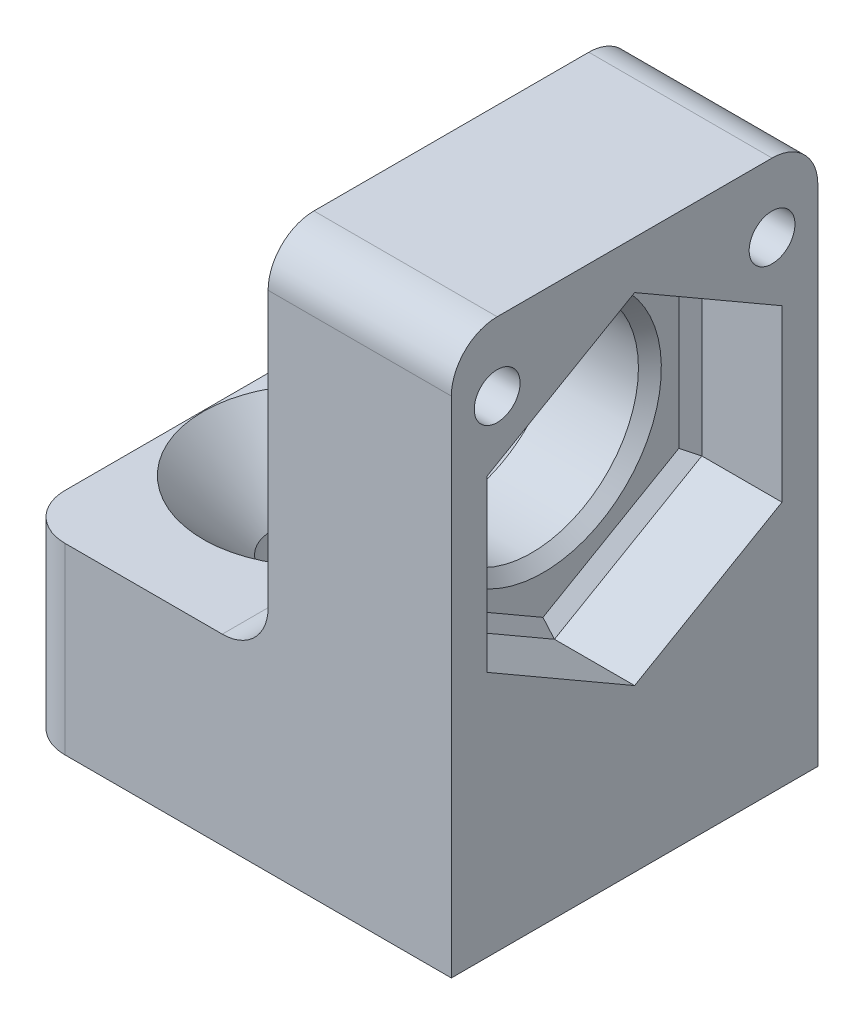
ISO-10303-21;
HEADER;
FILE_DESCRIPTION(('STEP AP214'),'2;1');
FILE_NAME('part.step','',(''),(''),'','','');
FILE_SCHEMA(('AUTOMOTIVE_DESIGN { 1 0 10303 214 1 1 1 1 }'));
ENDSEC;
DATA;
#1=APPLICATION_CONTEXT('core data for automotive mechanical design processes');
#2=APPLICATION_PROTOCOL_DEFINITION('international standard','automotive_design',2000,#1);
#3=PRODUCT_CONTEXT('',#1,'mechanical');
#4=PRODUCT('Part','Part','',(#3));
#5=PRODUCT_RELATED_PRODUCT_CATEGORY('part','',(#4));
#6=PRODUCT_DEFINITION_FORMATION('','',#4);
#7=PRODUCT_DEFINITION_CONTEXT('part definition',#1,'design');
#8=PRODUCT_DEFINITION('design','',#6,#7);
#9=PRODUCT_DEFINITION_SHAPE('','',#8);
#10=(LENGTH_UNIT() NAMED_UNIT(*) SI_UNIT(.MILLI.,.METRE.));
#11=(NAMED_UNIT(*) PLANE_ANGLE_UNIT() SI_UNIT($,.RADIAN.));
#12=(NAMED_UNIT(*) SI_UNIT($,.STERADIAN.) SOLID_ANGLE_UNIT());
#13=UNCERTAINTY_MEASURE_WITH_UNIT(LENGTH_MEASURE(1.E-05),#10,'distance_accuracy_value','');
#14=(GEOMETRIC_REPRESENTATION_CONTEXT(3) GLOBAL_UNCERTAINTY_ASSIGNED_CONTEXT((#13)) GLOBAL_UNIT_ASSIGNED_CONTEXT((#10,
#11,#12)) REPRESENTATION_CONTEXT('',''));
#15=CARTESIAN_POINT('',(0.,0.,0.));
#16=DIRECTION('',(0.,0.,1.));
#17=DIRECTION('',(1.,0.,0.));
#18=AXIS2_PLACEMENT_3D('',#15,#16,#17);
#19=CARTESIAN_POINT('',(-28.3004385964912,17.2274927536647,0.));
#20=DIRECTION('',(1.,0.,0.));
#21=DIRECTION('',(0.,1.,0.));
#22=AXIS2_PLACEMENT_3D('',#19,#20,#21);
#23=CYLINDRICAL_SURFACE('',#22,7.);
#24=CARTESIAN_POINT('',(-6.75,17.2274927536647,0.));
#25=DIRECTION('',(1.,0.,0.));
#26=DIRECTION('',(0.,0.,-1.));
#27=AXIS2_PLACEMENT_3D('',#24,#25,#26);
#28=CIRCLE('',#27,7.);
#29=CARTESIAN_POINT('',(-6.75,17.2274927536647,-7.));
#30=VERTEX_POINT('',#29);
#31=EDGE_CURVE('E784',#30,#30,#28,.T.);
#32=ORIENTED_EDGE('',*,*,#31,.T.);
#33=EDGE_LOOP('',(#32));
#34=FACE_BOUND('',#33,.T.);
#35=CARTESIAN_POINT('',(-12.,17.2274927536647,0.));
#36=DIRECTION('',(1.,0.,0.));
#37=DIRECTION('',(0.,1.,0.));
#38=AXIS2_PLACEMENT_3D('',#35,#36,#37);
#39=CIRCLE('',#38,7.);
#40=CARTESIAN_POINT('',(-12.,24.2274927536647,0.));
#41=VERTEX_POINT('',#40);
#42=EDGE_CURVE('E237',#41,#41,#39,.T.);
#43=ORIENTED_EDGE('',*,*,#42,.F.);
#44=EDGE_LOOP('',(#43));
#45=FACE_BOUND('',#44,.T.);
#46=ADVANCED_FACE('F35',(#34,#45),#23,.F.);
#47=CARTESIAN_POINT('',(-28.3004385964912,-4.5,12.));
#48=DIRECTION('',(1.,0.,0.));
#49=DIRECTION('',(0.,0.,-1.));
#50=AXIS2_PLACEMENT_3D('',#47,#48,#49);
#51=PLANE('',#50);
#52=DIRECTION('',(0.,0.,-1.));
#53=VECTOR('',#52,1.);
#54=CARTESIAN_POINT('',(-28.3004385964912,7.5,12.));
#55=LINE('',#54,#53);
#56=CARTESIAN_POINT('',(-28.3004385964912,7.5,9.));
#57=VERTEX_POINT('',#56);
#58=CARTESIAN_POINT('',(-28.3004385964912,7.5,-9.));
#59=VERTEX_POINT('',#58);
#60=EDGE_CURVE('E250',#57,#59,#55,.T.);
#61=ORIENTED_EDGE('',*,*,#60,.T.);
#62=DIRECTION('',(0.,-1.,0.));
#63=VECTOR('',#62,1.);
#64=CARTESIAN_POINT('',(-28.3004385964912,-4.5,-9.));
#65=LINE('',#64,#63);
#66=CARTESIAN_POINT('',(-28.3004385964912,-4.5,-9.));
#67=VERTEX_POINT('',#66);
#68=EDGE_CURVE('E457',#59,#67,#65,.T.);
#69=ORIENTED_EDGE('',*,*,#68,.T.);
#70=DIRECTION('',(0.,0.,-1.));
#71=VECTOR('',#70,1.);
#72=CARTESIAN_POINT('',(-28.3004385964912,-4.5,12.));
#73=LINE('',#72,#71);
#74=CARTESIAN_POINT('',(-28.3004385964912,-4.5,9.));
#75=VERTEX_POINT('',#74);
#76=EDGE_CURVE('E272',#75,#67,#73,.T.);
#77=ORIENTED_EDGE('',*,*,#76,.F.);
#78=DIRECTION('',(0.,-1.,0.));
#79=VECTOR('',#78,1.);
#80=CARTESIAN_POINT('',(-28.3004385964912,7.5,9.));
#81=LINE('',#80,#79);
#82=EDGE_CURVE('E460',#75,#57,#81,.F.);
#83=ORIENTED_EDGE('',*,*,#82,.T.);
#84=EDGE_LOOP('',(#61,#69,#77,#83));
#85=FACE_BOUND('',#84,.T.);
#86=ADVANCED_FACE('F395',(#85),#51,.F.);
#87=CARTESIAN_POINT('',(0.,-4.5,12.));
#88=DIRECTION('',(0.,1.,0.));
#89=DIRECTION('',(-1.,0.,0.));
#90=AXIS2_PLACEMENT_3D('',#87,#88,#89);
#91=PLANE('',#90);
#92=CARTESIAN_POINT('',(-21.,-4.5,0.));
#93=DIRECTION('',(0.,1.,0.));
#94=DIRECTION('',(-1.,0.,0.));
#95=AXIS2_PLACEMENT_3D('',#92,#93,#94);
#96=CIRCLE('',#95,2.75);
#97=CARTESIAN_POINT('',(-23.75,-4.5,0.));
#98=VERTEX_POINT('',#97);
#99=EDGE_CURVE('E225',#98,#98,#96,.T.);
#100=ORIENTED_EDGE('',*,*,#99,.T.);
#101=EDGE_LOOP('',(#100));
#102=FACE_BOUND('',#101,.T.);
#103=ORIENTED_EDGE('',*,*,#76,.T.);
#104=CARTESIAN_POINT('',(-25.3004385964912,-4.5,-9.));
#105=DIRECTION('',(0.,1.,0.));
#106=DIRECTION('',(-1.,0.,0.));
#107=AXIS2_PLACEMENT_3D('',#104,#105,#106);
#108=CIRCLE('',#107,3.);
#109=CARTESIAN_POINT('',(-25.3004385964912,-4.5,-12.));
#110=VERTEX_POINT('',#109);
#111=EDGE_CURVE('E450',#67,#110,#108,.F.);
#112=ORIENTED_EDGE('',*,*,#111,.T.);
#113=DIRECTION('',(1.,0.,0.));
#114=VECTOR('',#113,1.);
#115=CARTESIAN_POINT('',(0.,-4.5,-12.));
#116=LINE('',#115,#114);
#117=CARTESIAN_POINT('',(0.,-4.5,-12.));
#118=VERTEX_POINT('',#117);
#119=EDGE_CURVE('E251',#110,#118,#116,.T.);
#120=ORIENTED_EDGE('',*,*,#119,.T.);
#121=DIRECTION('',(0.,0.,-1.));
#122=VECTOR('',#121,1.);
#123=CARTESIAN_POINT('',(0.,-4.5,12.));
#124=LINE('',#123,#122);
#125=CARTESIAN_POINT('',(0.,-4.5,12.));
#126=VERTEX_POINT('',#125);
#127=EDGE_CURVE('E269',#126,#118,#124,.T.);
#128=ORIENTED_EDGE('',*,*,#127,.F.);
#129=DIRECTION('',(1.,0.,0.));
#130=VECTOR('',#129,1.);
#131=CARTESIAN_POINT('',(0.,-4.5,12.));
#132=LINE('',#131,#130);
#133=CARTESIAN_POINT('',(-25.3004385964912,-4.5,12.));
#134=VERTEX_POINT('',#133);
#135=EDGE_CURVE('E238',#134,#126,#132,.T.);
#136=ORIENTED_EDGE('',*,*,#135,.F.);
#137=CARTESIAN_POINT('',(-25.3004385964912,-4.5,9.));
#138=DIRECTION('',(0.,1.,0.));
#139=DIRECTION('',(-1.,0.,0.));
#140=AXIS2_PLACEMENT_3D('',#137,#138,#139);
#141=CIRCLE('',#140,3.);
#142=EDGE_CURVE('E453',#134,#75,#141,.F.);
#143=ORIENTED_EDGE('',*,*,#142,.T.);
#144=EDGE_LOOP('',(#103,#112,#120,#128,#136,#143));
#145=FACE_BOUND('',#144,.T.);
#146=ADVANCED_FACE('F401',(#102,#145),#91,.F.);
#147=CARTESIAN_POINT('',(0.,31.5,12.));
#148=DIRECTION('',(-1.,0.,0.));
#149=DIRECTION('',(0.,-1.,0.));
#150=AXIS2_PLACEMENT_3D('',#147,#148,#149);
#151=PLANE('',#150);
#152=DIRECTION('',(0.,-0.5,0.866025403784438));
#153=VECTOR('',#152,1.);
#154=CARTESIAN_POINT('',(0.,28.3703529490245,0.));
#155=LINE('',#154,#153);
#156=CARTESIAN_POINT('',(0.,28.3703529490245,0.));
#157=VERTEX_POINT('',#156);
#158=CARTESIAN_POINT('',(0.,22.7989228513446,9.65));
#159=VERTEX_POINT('',#158);
#160=EDGE_CURVE('E194',#157,#159,#155,.T.);
#161=ORIENTED_EDGE('',*,*,#160,.F.);
#162=DIRECTION('',(0.,0.5,0.866025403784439));
#163=VECTOR('',#162,1.);
#164=CARTESIAN_POINT('',(0.,22.7989228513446,-9.65));
#165=LINE('',#164,#163);
#166=CARTESIAN_POINT('',(0.,22.7989228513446,-9.65));
#167=VERTEX_POINT('',#166);
#168=EDGE_CURVE('E199',#167,#157,#165,.T.);
#169=ORIENTED_EDGE('',*,*,#168,.F.);
#170=DIRECTION('',(0.,1.,0.));
#171=VECTOR('',#170,1.);
#172=CARTESIAN_POINT('',(0.,11.6560626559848,-9.65));
#173=LINE('',#172,#171);
#174=CARTESIAN_POINT('',(0.,11.6560626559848,-9.65));
#175=VERTEX_POINT('',#174);
#176=EDGE_CURVE('E213',#175,#167,#173,.T.);
#177=ORIENTED_EDGE('',*,*,#176,.F.);
#178=DIRECTION('',(0.,0.5,-0.866025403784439));
#179=VECTOR('',#178,1.);
#180=CARTESIAN_POINT('',(0.,6.0846325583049,0.));
#181=LINE('',#180,#179);
#182=CARTESIAN_POINT('',(0.,6.0846325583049,0.));
#183=VERTEX_POINT('',#182);
#184=EDGE_CURVE('E207',#183,#175,#181,.T.);
#185=ORIENTED_EDGE('',*,*,#184,.F.);
#186=DIRECTION('',(0.,-0.5,-0.866025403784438));
#187=VECTOR('',#186,1.);
#188=CARTESIAN_POINT('',(0.,11.6560626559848,9.65));
#189=LINE('',#188,#187);
#190=CARTESIAN_POINT('',(0.,11.6560626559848,9.65));
#191=VERTEX_POINT('',#190);
#192=EDGE_CURVE('E205',#191,#183,#189,.T.);
#193=ORIENTED_EDGE('',*,*,#192,.F.);
#194=DIRECTION('',(0.,-1.,0.));
#195=VECTOR('',#194,1.);
#196=CARTESIAN_POINT('',(0.,22.7989228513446,9.65));
#197=LINE('',#196,#195);
#198=EDGE_CURVE('E187',#159,#191,#197,.T.);
#199=ORIENTED_EDGE('',*,*,#198,.F.);
#200=EDGE_LOOP('',(#161,#169,#177,#185,#193,#199));
#201=FACE_BOUND('',#200,.T.);
#202=CARTESIAN_POINT('',(0.,27.,9.));
#203=DIRECTION('',(-1.,0.,0.));
#204=DIRECTION('',(0.,-1.,0.));
#205=AXIS2_PLACEMENT_3D('',#202,#203,#204);
#206=CIRCLE('',#205,1.5);
#207=CARTESIAN_POINT('',(0.,25.5,9.));
#208=VERTEX_POINT('',#207);
#209=EDGE_CURVE('E234',#208,#208,#206,.T.);
#210=ORIENTED_EDGE('',*,*,#209,.T.);
#211=EDGE_LOOP('',(#210));
#212=FACE_BOUND('',#211,.T.);
#213=CARTESIAN_POINT('',(0.,27.,-9.));
#214=DIRECTION('',(-1.,0.,0.));
#215=DIRECTION('',(0.,-1.,0.));
#216=AXIS2_PLACEMENT_3D('',#213,#214,#215);
#217=CIRCLE('',#216,1.5);
#218=CARTESIAN_POINT('',(0.,25.5,-9.));
#219=VERTEX_POINT('',#218);
#220=EDGE_CURVE('E230',#219,#219,#217,.T.);
#221=ORIENTED_EDGE('',*,*,#220,.T.);
#222=EDGE_LOOP('',(#221));
#223=FACE_BOUND('',#222,.T.);
#224=DIRECTION('',(0.,1.,0.));
#225=VECTOR('',#224,1.);
#226=CARTESIAN_POINT('',(0.,31.5,-12.));
#227=LINE('',#226,#225);
#228=CARTESIAN_POINT('',(0.,28.5,-12.));
#229=VERTEX_POINT('',#228);
#230=EDGE_CURVE('E253',#118,#229,#227,.T.);
#231=ORIENTED_EDGE('',*,*,#230,.T.);
#232=CARTESIAN_POINT('',(0.,28.5,-9.));
#233=DIRECTION('',(-1.,0.,0.));
#234=DIRECTION('',(0.,-1.,0.));
#235=AXIS2_PLACEMENT_3D('',#232,#233,#234);
#236=CIRCLE('',#235,3.);
#237=CARTESIAN_POINT('',(0.,31.5,-9.));
#238=VERTEX_POINT('',#237);
#239=EDGE_CURVE('E467',#229,#238,#236,.F.);
#240=ORIENTED_EDGE('',*,*,#239,.T.);
#241=DIRECTION('',(0.,0.,-1.));
#242=VECTOR('',#241,1.);
#243=CARTESIAN_POINT('',(0.,31.5,12.));
#244=LINE('',#243,#242);
#245=CARTESIAN_POINT('',(0.,31.5,9.));
#246=VERTEX_POINT('',#245);
#247=EDGE_CURVE('E266',#246,#238,#244,.T.);
#248=ORIENTED_EDGE('',*,*,#247,.F.);
#249=CARTESIAN_POINT('',(0.,28.5,9.));
#250=DIRECTION('',(-1.,0.,0.));
#251=DIRECTION('',(0.,-1.,0.));
#252=AXIS2_PLACEMENT_3D('',#249,#250,#251);
#253=CIRCLE('',#252,3.);
#254=CARTESIAN_POINT('',(0.,28.5,12.));
#255=VERTEX_POINT('',#254);
#256=EDGE_CURVE('E469',#246,#255,#253,.F.);
#257=ORIENTED_EDGE('',*,*,#256,.T.);
#258=DIRECTION('',(0.,1.,0.));
#259=VECTOR('',#258,1.);
#260=CARTESIAN_POINT('',(0.,31.5,12.));
#261=LINE('',#260,#259);
#262=EDGE_CURVE('E240',#126,#255,#261,.T.);
#263=ORIENTED_EDGE('',*,*,#262,.F.);
#264=ORIENTED_EDGE('',*,*,#127,.T.);
#265=EDGE_LOOP('',(#231,#240,#248,#257,#263,#264));
#266=FACE_BOUND('',#265,.T.);
#267=ADVANCED_FACE('F201',(#201,#212,#223,#266),#151,.F.);
#268=CARTESIAN_POINT('',(0.,31.5,12.));
#269=DIRECTION('',(0.,-1.,0.));
#270=DIRECTION('',(0.,0.,-1.));
#271=AXIS2_PLACEMENT_3D('',#268,#269,#270);
#272=PLANE('',#271);
#273=ORIENTED_EDGE('',*,*,#247,.T.);
#274=DIRECTION('',(-1.,0.,0.));
#275=VECTOR('',#274,1.);
#276=CARTESIAN_POINT('',(0.,31.5,-9.));
#277=LINE('',#276,#275);
#278=CARTESIAN_POINT('',(-12.,31.5,-9.));
#279=VERTEX_POINT('',#278);
#280=EDGE_CURVE('E475',#238,#279,#277,.T.);
#281=ORIENTED_EDGE('',*,*,#280,.T.);
#282=DIRECTION('',(0.,0.,-1.));
#283=VECTOR('',#282,1.);
#284=CARTESIAN_POINT('',(-12.,31.5,12.));
#285=LINE('',#284,#283);
#286=CARTESIAN_POINT('',(-12.,31.5,9.));
#287=VERTEX_POINT('',#286);
#288=EDGE_CURVE('E263',#287,#279,#285,.T.);
#289=ORIENTED_EDGE('',*,*,#288,.F.);
#290=DIRECTION('',(-1.,0.,0.));
#291=VECTOR('',#290,1.);
#292=CARTESIAN_POINT('',(0.,31.5,9.));
#293=LINE('',#292,#291);
#294=EDGE_CURVE('E477',#287,#246,#293,.F.);
#295=ORIENTED_EDGE('',*,*,#294,.T.);
#296=EDGE_LOOP('',(#273,#281,#289,#295));
#297=FACE_BOUND('',#296,.T.);
#298=ADVANCED_FACE('F423',(#297),#272,.F.);
#299=CARTESIAN_POINT('',(-12.,31.5,12.));
#300=DIRECTION('',(1.,0.,0.));
#301=DIRECTION('',(0.,1.,0.));
#302=AXIS2_PLACEMENT_3D('',#299,#300,#301);
#303=PLANE('',#302);
#304=CARTESIAN_POINT('',(-12.,27.,9.));
#305=DIRECTION('',(1.,0.,0.));
#306=DIRECTION('',(0.,1.,0.));
#307=AXIS2_PLACEMENT_3D('',#304,#305,#306);
#308=CIRCLE('',#307,1.5);
#309=CARTESIAN_POINT('',(-12.,28.5,9.));
#310=VERTEX_POINT('',#309);
#311=EDGE_CURVE('E233',#310,#310,#308,.T.);
#312=ORIENTED_EDGE('',*,*,#311,.T.);
#313=EDGE_LOOP('',(#312));
#314=FACE_BOUND('',#313,.T.);
#315=CARTESIAN_POINT('',(-12.,27.,-9.));
#316=DIRECTION('',(1.,0.,0.));
#317=DIRECTION('',(0.,1.,0.));
#318=AXIS2_PLACEMENT_3D('',#315,#316,#317);
#319=CIRCLE('',#318,1.5);
#320=CARTESIAN_POINT('',(-12.,28.5,-9.));
#321=VERTEX_POINT('',#320);
#322=EDGE_CURVE('E228',#321,#321,#319,.T.);
#323=ORIENTED_EDGE('',*,*,#322,.T.);
#324=EDGE_LOOP('',(#323));
#325=FACE_BOUND('',#324,.T.);
#326=ORIENTED_EDGE('',*,*,#42,.T.);
#327=EDGE_LOOP('',(#326));
#328=FACE_BOUND('',#327,.T.);
#329=DIRECTION('',(0.,-1.,0.));
#330=VECTOR('',#329,1.);
#331=CARTESIAN_POINT('',(-12.,31.5,-12.));
#332=LINE('',#331,#330);
#333=CARTESIAN_POINT('',(-12.,28.5,-12.));
#334=VERTEX_POINT('',#333);
#335=CARTESIAN_POINT('',(-12.,10.5,-12.));
#336=VERTEX_POINT('',#335);
#337=EDGE_CURVE('E256',#334,#336,#332,.T.);
#338=ORIENTED_EDGE('',*,*,#337,.T.);
#339=DIRECTION('',(0.,0.,-1.));
#340=VECTOR('',#339,1.);
#341=CARTESIAN_POINT('',(-12.,10.5,12.));
#342=LINE('',#341,#340);
#343=CARTESIAN_POINT('',(-12.,10.5,-4.069705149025));
#344=VERTEX_POINT('',#343);
#345=EDGE_CURVE('E310',#336,#344,#342,.F.);
#346=ORIENTED_EDGE('',*,*,#345,.T.);
#347=CARTESIAN_POINT('',(-15.8318898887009,7.5,5.08459810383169));
#348=CARTESIAN_POINT('',(-12.,6.43958155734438,4.7705651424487));
#349=CARTESIAN_POINT('',(-12.,10.2637118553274,5.90304541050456));
#350=CARTESIAN_POINT('',(-15.7628445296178,7.5,5.01438811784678));
#351=CARTESIAN_POINT('',(-12.,6.54184214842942,4.77132005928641));
#352=CARTESIAN_POINT('',(-12.,10.3112369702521,5.74253702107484));
#353=CARTESIAN_POINT('',(-15.691354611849,7.5,4.93889211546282));
#354=CARTESIAN_POINT('',(-12.,6.64716684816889,4.75162963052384));
#355=CARTESIAN_POINT('',(-12.,10.3503610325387,5.57979184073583));
#356=CARTESIAN_POINT('',(-15.5449774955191,7.5,4.77673720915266));
#357=CARTESIAN_POINT('',(-12.,6.85365463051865,4.67554139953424));
#358=CARTESIAN_POINT('',(-12.,10.4138503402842,5.25179012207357));
#359=CARTESIAN_POINT('',(-15.4700982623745,7.5,4.69010367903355));
#360=CARTESIAN_POINT('',(-12.,6.95492781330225,4.62032328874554));
#361=CARTESIAN_POINT('',(-12.,10.4382484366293,5.08654002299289));
#362=CARTESIAN_POINT('',(-15.3190394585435,7.5,4.5059046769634));
#363=CARTESIAN_POINT('',(-12.,7.14688773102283,4.47969398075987));
#364=CARTESIAN_POINT('',(-12.,10.4743018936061,4.75677950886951));
#365=CARTESIAN_POINT('',(-15.2428868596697,7.5,4.4084853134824));
#366=CARTESIAN_POINT('',(-12.,7.23795378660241,4.39550800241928));
#367=CARTESIAN_POINT('',(-12.,10.486108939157,4.59228462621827));
#368=CARTESIAN_POINT('',(-15.0898673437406,7.5,4.20112417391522));
#369=CARTESIAN_POINT('',(-12.,7.40829240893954,4.20229243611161));
#370=CARTESIAN_POINT('',(-12.,10.4996224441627,4.26287413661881));
#371=CARTESIAN_POINT('',(-15.0130002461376,7.5,4.09117914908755));
#372=CARTESIAN_POINT('',(-12.,7.48794412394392,4.09382842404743));
#373=CARTESIAN_POINT('',(-12.,10.5013262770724,4.09795843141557));
#374=CARTESIAN_POINT('',(-14.8525102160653,7.5,3.84634955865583));
#375=CARTESIAN_POINT('',(-12.,7.64154425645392,3.84504143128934));
#376=CARTESIAN_POINT('',(-12.,10.4965279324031,3.75158619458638));
#377=CARTESIAN_POINT('',(-14.768991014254,7.5,3.71006704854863));
#378=CARTESIAN_POINT('',(-12.,7.71482577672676,3.70269767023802));
#379=CARTESIAN_POINT('',(-12.,10.4891776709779,3.57014507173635));
#380=CARTESIAN_POINT('',(-14.6056801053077,7.5,3.42092661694));
#381=CARTESIAN_POINT('',(-12.,7.84579604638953,3.39870636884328));
#382=CARTESIAN_POINT('',(-12.,10.4676852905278,3.2076525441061));
#383=CARTESIAN_POINT('',(-14.5258894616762,7.5,3.2680640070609));
#384=CARTESIAN_POINT('',(-12.,7.90398787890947,3.23721185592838));
#385=CARTESIAN_POINT('',(-12.,10.453541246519,3.02660126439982));
#386=CARTESIAN_POINT('',(-14.3728710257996,7.5,2.94543124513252));
#387=CARTESIAN_POINT('',(-12.,8.00597620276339,2.89893404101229));
#388=CARTESIAN_POINT('',(-12.,10.4213623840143,2.66461161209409));
#389=CARTESIAN_POINT('',(-14.2996525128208,7.5,2.77563788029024));
#390=CARTESIAN_POINT('',(-12.,8.05018936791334,2.72201514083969));
#391=CARTESIAN_POINT('',(-12.,10.4033221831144,2.48367374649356));
#392=CARTESIAN_POINT('',(-14.1631342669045,7.5,2.41992351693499));
#393=CARTESIAN_POINT('',(-12.,8.1258451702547,2.35652990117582));
#394=CARTESIAN_POINT('',(-12.,10.3663311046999,2.12190760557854));
#395=CARTESIAN_POINT('',(-14.0998339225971,7.5,2.2340035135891));
#396=CARTESIAN_POINT('',(-12.,8.15763203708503,2.16761075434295));
#397=CARTESIAN_POINT('',(-12.,10.3473802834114,1.94107932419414));
#398=CARTESIAN_POINT('',(-13.9864133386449,7.5,1.84735467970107));
#399=CARTESIAN_POINT('',(-12.,8.2104441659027,1.78076658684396));
#400=CARTESIAN_POINT('',(-12.,10.3114551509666,1.57891267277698));
#401=CARTESIAN_POINT('',(-13.9363151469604,7.5,1.64660178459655));
#402=CARTESIAN_POINT('',(-12.,8.23170113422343,1.5822446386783));
#403=CARTESIAN_POINT('',(-12.,10.2944841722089,1.39757395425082));
#404=CARTESIAN_POINT('',(-13.852619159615,7.5,1.23360860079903));
#405=CARTESIAN_POINT('',(-12.,8.26523974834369,1.17934860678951));
#406=CARTESIAN_POINT('',(-12.,10.2652255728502,1.03451139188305));
#407=CARTESIAN_POINT('',(-13.8190201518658,7.5,1.02136915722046));
#408=CARTESIAN_POINT('',(-12.,8.27768196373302,0.974201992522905));
#409=CARTESIAN_POINT('',(-12.,10.2529376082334,0.852787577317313));
#410=CARTESIAN_POINT('',(-13.7708194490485,7.5,0.590237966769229));
#411=CARTESIAN_POINT('',(-12.,8.29501268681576,0.561341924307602));
#412=CARTESIAN_POINT('',(-12.,10.2350921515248,0.48927142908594));
#413=CARTESIAN_POINT('',(-13.7561885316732,7.5,0.371356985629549));
#414=CARTESIAN_POINT('',(-12.,8.29999477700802,0.352718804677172));
#415=CARTESIAN_POINT('',(-12.,10.2295243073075,0.307479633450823));
#416=CARTESIAN_POINT('',(-13.7469899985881,7.5,-0.0677663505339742));
#417=CARTESIAN_POINT('',(-12.,8.30313976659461,-0.0642675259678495));
#418=CARTESIAN_POINT('',(-12.,10.2260369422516,-0.0561771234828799));
#419=CARTESIAN_POINT('',(-13.7524219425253,7.5,-0.288008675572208));
#420=CARTESIAN_POINT('',(-12.,8.30131761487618,-0.273614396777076));
#421=CARTESIAN_POINT('',(-12.,10.2281172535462,-0.238042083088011));
#422=CARTESIAN_POINT('',(-13.7857447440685,7.5,-0.764114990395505));
#423=CARTESIAN_POINT('',(-12.,8.2897079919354,-0.727298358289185));
#424=CARTESIAN_POINT('',(-12.,10.2406443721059,-0.634973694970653));
#425=CARTESIAN_POINT('',(-13.8175843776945,7.5,-1.01907630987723));
#426=CARTESIAN_POINT('',(-12.,8.27844191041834,-0.972275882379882));
#427=CARTESIAN_POINT('',(-12.,10.2525602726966,-0.849991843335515));
#428=CARTESIAN_POINT('',(-13.9054872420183,7.5,-1.51456065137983));
#429=CARTESIAN_POINT('',(-12.,8.24441937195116,-1.45275505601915));
#430=CARTESIAN_POINT('',(-12.,10.2838937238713,-1.27957291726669));
#431=CARTESIAN_POINT('',(-13.9615660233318,7.5,-1.75507429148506));
#432=CARTESIAN_POINT('',(-12.,8.22142851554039,-1.68960754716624));
#433=CARTESIAN_POINT('',(-12.,10.3033160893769,-1.49413546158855));
#434=CARTESIAN_POINT('',(-14.0929378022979,7.5,-2.21646659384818));
#435=CARTESIAN_POINT('',(-12.,8.16119261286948,-2.15007607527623));
#436=CARTESIAN_POINT('',(-12.,10.3454062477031,-1.92334714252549));
#437=CARTESIAN_POINT('',(-14.1682685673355,7.5,-2.43730549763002));
#438=CARTESIAN_POINT('',(-12.,8.12352008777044,-2.37465238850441));
#439=CARTESIAN_POINT('',(-12.,10.3680803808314,-2.137995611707));
#440=CARTESIAN_POINT('',(-14.3324746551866,7.5,-2.85609288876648));
#441=CARTESIAN_POINT('',(-12.,8.03097744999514,-2.80593516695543));
#442=CARTESIAN_POINT('',(-12.,10.4117645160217,-2.56750645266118));
#443=CARTESIAN_POINT('',(-14.4213520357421,7.5,-3.05403789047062));
#444=CARTESIAN_POINT('',(-12.,7.975514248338,-3.01319333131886));
#445=CARTESIAN_POINT('',(-12.,10.4327742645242,-2.78236885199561));
#446=CARTESIAN_POINT('',(-14.6076887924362,7.5,-3.4270283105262));
#447=CARTESIAN_POINT('',(-12.,7.84466627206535,-3.40554198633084));
#448=CARTESIAN_POINT('',(-12.,10.4682314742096,-3.21354818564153));
#449=CARTESIAN_POINT('',(-14.7051808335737,7.5,-3.60197971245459));
#450=CARTESIAN_POINT('',(-12.,7.76843273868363,-3.59058209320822));
#451=CARTESIAN_POINT('',(-12.,10.4826525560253,-3.42986750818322));
#452=CARTESIAN_POINT('',(-14.9035774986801,7.5,-3.92843395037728));
#453=CARTESIAN_POINT('',(-12.,7.5950978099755,-3.93055341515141));
#454=CARTESIAN_POINT('',(-12.,10.4998550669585,-3.8627805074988));
#455=CARTESIAN_POINT('',(-15.0044778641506,7.5,-4.07996481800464));
#456=CARTESIAN_POINT('',(-12.,7.49711860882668,-4.08502019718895));
#457=CARTESIAN_POINT('',(-12.,10.5026505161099,-4.07937353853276));
#458=CARTESIAN_POINT('',(-15.2066790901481,7.5,-4.36237975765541));
#459=CARTESIAN_POINT('',(-12.,7.28044332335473,-4.35655057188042));
#460=CARTESIAN_POINT('',(-12.,10.4917258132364,-4.51418677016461));
#461=CARTESIAN_POINT('',(-15.3079759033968,7.5,-4.49307455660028));
#462=CARTESIAN_POINT('',(-12.,7.16069003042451,-4.4720559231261));
#463=CARTESIAN_POINT('',(-12.,10.4778630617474,-4.73240489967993));
#464=CARTESIAN_POINT('',(-15.4571417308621,7.5,-4.67390200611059));
#465=CARTESIAN_POINT('',(-12.,6.97172098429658,-4.60647320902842));
#466=CARTESIAN_POINT('',(-12.,10.440780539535,-5.05839119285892));
#467=CARTESIAN_POINT('',(-15.5065140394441,7.5,-4.73176086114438));
#468=CARTESIAN_POINT('',(-12.,6.90598287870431,-4.64513287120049));
#469=CARTESIAN_POINT('',(-12.,10.4256496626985,-5.16708560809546));
#470=CARTESIAN_POINT('',(-15.6039208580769,7.5,-4.84254704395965));
#471=CARTESIAN_POINT('',(-12.,6.77208895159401,-4.70807793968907));
#472=CARTESIAN_POINT('',(-12.,10.3893089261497,-5.38353728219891));
#473=CARTESIAN_POINT('',(-15.6519542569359,7.5,-4.89547035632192));
#474=CARTESIAN_POINT('',(-12.,6.70388213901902,-4.73205901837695));
#475=CARTESIAN_POINT('',(-12.,10.3680941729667,-5.49129371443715));
#476=CARTESIAN_POINT('',(-15.6991165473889,7.5,-4.94602210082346));
#477=CARTESIAN_POINT('',(-12.,6.63599880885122,-4.74781813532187));
#478=CARTESIAN_POINT('',(-12.,10.3435402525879,-5.59833712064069));
#479=(BOUNDED_SURFACE() B_SPLINE_SURFACE(3,2,((#347,#348,#349),(#350,#351,#352),(#353,#354,
#355),(#356,#357,#358),(#359,#360,#361),(#362,#363,#364),(#365,#366,#367),(#368,#369,#370),
(#371,#372,#373),(#374,#375,#376),(#377,#378,#379),(#380,#381,#382),(#383,#384,#385),(#386,#387,
#388),(#389,#390,#391),(#392,#393,#394),(#395,#396,#397),(#398,#399,#400),(#401,#402,#403),
(#404,#405,#406),(#407,#408,#409),(#410,#411,#412),(#413,#414,#415),(#416,#417,#418),(#419,#420,
#421),(#422,#423,#424),(#425,#426,#427),(#428,#429,#430),(#431,#432,#433),(#434,#435,#436),
(#437,#438,#439),(#440,#441,#442),(#443,#444,#445),(#446,#447,#448),(#449,#450,#451),(#452,#453,
#454),(#455,#456,#457),(#458,#459,#460),(#461,#462,#463),(#464,#465,#466),(#467,#468,#469),
(#470,#471,#472),(#473,#474,#475),(#476,#477,#478)),.UNSPECIFIED.,.F.,.F.,
.F.) B_SPLINE_SURFACE_WITH_KNOTS((4,2,2,2,2,2,2,2,2,2,2,2,2,2,2,2,2,2,2,2,2,4),(3,3),(0.,
0.501618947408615,1.00211470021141,1.49651038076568,1.99103458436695,2.5356153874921,
3.08035058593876,3.62584318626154,4.17130214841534,4.71766635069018,5.26399040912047,
5.80947179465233,6.35494120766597,7.00078338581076,7.64704052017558,8.29457530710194,
8.94220855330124,9.59241251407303,10.2418321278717,10.8968508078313,11.2259224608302,
11.5552595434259),(0.,1.),
.UNSPECIFIED.) GEOMETRIC_REPRESENTATION_ITEM() RATIONAL_B_SPLINE_SURFACE(((1.,0.60112534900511,
1.),(1.,0.610702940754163,1.),(1.,0.620378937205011,1.),(1.,0.639735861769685,1.),(1.,
0.649416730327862,1.),(1.,0.668518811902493,1.),(1.,0.677941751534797,1.),(1.,0.696497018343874,
1.),(1.,0.705629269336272,1.),(1.,0.724346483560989,1.),(1.,0.733883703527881,1.),(1.,
0.752199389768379,1.),(1.,0.760977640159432,1.),(1.,0.777554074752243,1.),(1.,0.785350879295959,
1.),(1.,0.79970571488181,1.),(1.,0.806263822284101,1.),(1.,0.817902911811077,1.),(1.,
0.822981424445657,1.),(1.,0.831413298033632,1.),(1.,0.834766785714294,1.),(1.,0.839564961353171,
1.),(1.,0.841012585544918,1.),(1.,0.841923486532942,1.),(1.,0.841386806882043,1.),(1.,
0.838080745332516,1.),(1.,0.834918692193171,1.),(1.,0.82609790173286,1.),(1.,0.820437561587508,
1.),(1.,0.806983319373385,1.),(1.,0.799185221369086,1.),(1.,0.781875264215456,1.),(1.,
0.772363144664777,1.),(1.,0.75199017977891,1.),(1.,0.741124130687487,1.),(1.,0.718469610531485,
1.),(1.,0.706682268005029,1.),(1.,0.682423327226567,1.),(1.,0.66994670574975,1.),(1.,
0.651037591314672,1.),(1.,0.644686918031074,1.),(1.,0.631970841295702,1.),(1.,0.625605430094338,
1.),(1.,0.619258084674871,1.))) REPRESENTATION_ITEM('') SURFACE());
#480=CARTESIAN_POINT('',(-12.,10.3435402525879,-5.59833712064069));
#481=CARTESIAN_POINT('',(-12.,10.3680941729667,-5.49129371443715));
#482=CARTESIAN_POINT('',(-12.,10.3893089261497,-5.38353728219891));
#483=CARTESIAN_POINT('',(-12.,10.4256496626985,-5.16708560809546));
#484=CARTESIAN_POINT('',(-12.,10.440780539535,-5.05839119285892));
#485=CARTESIAN_POINT('',(-12.,10.4778630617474,-4.73240489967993));
#486=CARTESIAN_POINT('',(-12.,10.4917258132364,-4.51418677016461));
#487=CARTESIAN_POINT('',(-12.,10.5026505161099,-4.07937353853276));
#488=CARTESIAN_POINT('',(-12.,10.4998550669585,-3.8627805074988));
#489=CARTESIAN_POINT('',(-12.,10.4826525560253,-3.42986750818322));
#490=CARTESIAN_POINT('',(-12.,10.4682314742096,-3.21354818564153));
#491=CARTESIAN_POINT('',(-12.,10.4327742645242,-2.78236885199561));
#492=CARTESIAN_POINT('',(-12.,10.4117645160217,-2.56750645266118));
#493=CARTESIAN_POINT('',(-12.,10.3680803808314,-2.137995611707));
#494=CARTESIAN_POINT('',(-12.,10.3454062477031,-1.92334714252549));
#495=CARTESIAN_POINT('',(-12.,10.3033160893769,-1.49413546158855));
#496=CARTESIAN_POINT('',(-12.,10.2838937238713,-1.27957291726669));
#497=CARTESIAN_POINT('',(-12.,10.2525602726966,-0.849991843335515));
#498=CARTESIAN_POINT('',(-12.,10.2406443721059,-0.634973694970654));
#499=CARTESIAN_POINT('',(-12.,10.2281172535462,-0.238042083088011));
#500=CARTESIAN_POINT('',(-12.,10.2260369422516,-0.0561771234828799));
#501=CARTESIAN_POINT('',(-12.,10.2295243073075,0.307479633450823));
#502=CARTESIAN_POINT('',(-12.,10.2350921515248,0.48927142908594));
#503=CARTESIAN_POINT('',(-12.,10.2529376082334,0.852787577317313));
#504=CARTESIAN_POINT('',(-12.,10.2652255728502,1.03451139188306));
#505=CARTESIAN_POINT('',(-12.,10.2944841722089,1.39757395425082));
#506=CARTESIAN_POINT('',(-12.,10.3114551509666,1.57891267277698));
#507=CARTESIAN_POINT('',(-12.,10.3473802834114,1.94107932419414));
#508=CARTESIAN_POINT('',(-12.,10.3663311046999,2.12190760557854));
#509=CARTESIAN_POINT('',(-12.,10.4033221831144,2.48367374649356));
#510=CARTESIAN_POINT('',(-12.,10.4213623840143,2.66461161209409));
#511=CARTESIAN_POINT('',(-12.,10.453541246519,3.02660126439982));
#512=CARTESIAN_POINT('',(-12.,10.4676852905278,3.2076525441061));
#513=CARTESIAN_POINT('',(-12.,10.4891776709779,3.57014507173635));
#514=CARTESIAN_POINT('',(-12.,10.4965279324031,3.75158619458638));
#515=CARTESIAN_POINT('',(-12.,10.5013262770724,4.09795843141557));
#516=CARTESIAN_POINT('',(-12.,10.4996224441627,4.26287413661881));
#517=CARTESIAN_POINT('',(-12.,10.486108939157,4.59228462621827));
#518=CARTESIAN_POINT('',(-12.,10.4743018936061,4.75677950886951));
#519=CARTESIAN_POINT('',(-12.,10.4382484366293,5.08654002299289));
#520=CARTESIAN_POINT('',(-12.,10.4138503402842,5.25179012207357));
#521=CARTESIAN_POINT('',(-12.,10.3503610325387,5.57979184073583));
#522=CARTESIAN_POINT('',(-12.,10.3112369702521,5.74253702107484));
#523=CARTESIAN_POINT('',(-12.,10.2637118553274,5.90304541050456));
#524=B_SPLINE_CURVE_WITH_KNOTS('',3,(#480,#481,#482,#483,#484,#485,#486,#487,#488,#489,#490,
#491,#492,#493,#494,#495,#496,#497,#498,#499,#500,#501,#502,#503,#504,#505,#506,#507,#508,#509,
#510,#511,#512,#513,#514,#515,#516,#517,#518,#519,#520,#521,#522,#523),.UNSPECIFIED.,.F.,.F.,(4,
2,2,2,2,2,2,2,2,2,2,2,2,2,2,2,2,2,2,2,2,4),(0.,0.329337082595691,0.658408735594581,
1.31342741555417,1.96284702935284,2.61305099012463,3.26068423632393,3.90821902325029,
4.55447615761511,5.2003183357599,5.74578774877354,6.2912691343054,6.83759319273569,
7.38395739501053,7.92941635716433,8.47490895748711,9.01964415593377,9.56422495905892,
10.0587491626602,10.5531448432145,11.0536405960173,11.5552595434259),.UNSPECIFIED.);
#525=CARTESIAN_POINT('',(-12.,10.5,4.069705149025));
#526=VERTEX_POINT('',#525);
#527=EDGE_CURVE('E303',#344,#526,#524,.T.);
#528=ORIENTED_EDGE('',*,*,#527,.T.);
#529=DIRECTION('',(0.,0.,-1.));
#530=VECTOR('',#529,1.);
#531=CARTESIAN_POINT('',(-12.,10.5,12.));
#532=LINE('',#531,#530);
#533=CARTESIAN_POINT('',(-12.,10.5,12.));
#534=VERTEX_POINT('',#533);
#535=EDGE_CURVE('E301',#526,#534,#532,.F.);
#536=ORIENTED_EDGE('',*,*,#535,.T.);
#537=DIRECTION('',(0.,-1.,0.));
#538=VECTOR('',#537,1.);
#539=CARTESIAN_POINT('',(-12.,31.5,12.));
#540=LINE('',#539,#538);
#541=CARTESIAN_POINT('',(-12.,28.5,12.));
#542=VERTEX_POINT('',#541);
#543=EDGE_CURVE('E244',#542,#534,#540,.T.);
#544=ORIENTED_EDGE('',*,*,#543,.F.);
#545=CARTESIAN_POINT('',(-12.,28.5,9.));
#546=DIRECTION('',(1.,0.,0.));
#547=DIRECTION('',(0.,1.,0.));
#548=AXIS2_PLACEMENT_3D('',#545,#546,#547);
#549=CIRCLE('',#548,3.);
#550=EDGE_CURVE('E297',#542,#287,#549,.F.);
#551=ORIENTED_EDGE('',*,*,#550,.T.);
#552=ORIENTED_EDGE('',*,*,#288,.T.);
#553=CARTESIAN_POINT('',(-12.,28.5,-9.));
#554=DIRECTION('',(1.,0.,0.));
#555=DIRECTION('',(0.,1.,0.));
#556=AXIS2_PLACEMENT_3D('',#553,#554,#555);
#557=CIRCLE('',#556,3.);
#558=EDGE_CURVE('E299',#279,#334,#557,.F.);
#559=ORIENTED_EDGE('',*,*,#558,.T.);
#560=EDGE_LOOP('',(#338,#346,#528,#536,#544,#551,#552,#559));
#561=FACE_BOUND('',#560,.T.);
#562=ADVANCED_FACE('F312',(#314,#325,#328,#561),#303,.F.);
#563=CARTESIAN_POINT('',(-12.,7.5,12.));
#564=DIRECTION('',(0.,-1.,0.));
#565=DIRECTION('',(1.,0.,0.));
#566=AXIS2_PLACEMENT_3D('',#563,#564,#565);
#567=PLANE('',#566);
#568=DIRECTION('',(-1.,0.,0.));
#569=VECTOR('',#568,1.);
#570=CARTESIAN_POINT('',(-12.,7.5,12.));
#571=LINE('',#570,#569);
#572=CARTESIAN_POINT('',(-15.,7.5,12.));
#573=VERTEX_POINT('',#572);
#574=CARTESIAN_POINT('',(-25.3004385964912,7.5,12.));
#575=VERTEX_POINT('',#574);
#576=EDGE_CURVE('E247',#573,#575,#571,.T.);
#577=ORIENTED_EDGE('',*,*,#576,.F.);
#578=DIRECTION('',(0.,0.,-1.));
#579=VECTOR('',#578,1.);
#580=CARTESIAN_POINT('',(-15.,7.5,-12.));
#581=LINE('',#580,#579);
#582=CARTESIAN_POINT('',(-15.,7.5,4.069705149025));
#583=VERTEX_POINT('',#582);
#584=EDGE_CURVE('E294',#573,#583,#581,.T.);
#585=ORIENTED_EDGE('',*,*,#584,.T.);
#586=CARTESIAN_POINT('',(-21.,7.5,0.));
#587=DIRECTION('',(0.,-1.,0.));
#588=DIRECTION('',(1.,0.,0.));
#589=AXIS2_PLACEMENT_3D('',#586,#587,#588);
#590=CIRCLE('',#589,7.25000000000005);
#591=CARTESIAN_POINT('',(-15.,7.5,-4.069705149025));
#592=VERTEX_POINT('',#591);
#593=EDGE_CURVE('E285',#583,#592,#590,.T.);
#594=ORIENTED_EDGE('',*,*,#593,.T.);
#595=DIRECTION('',(0.,0.,-1.));
#596=VECTOR('',#595,1.);
#597=CARTESIAN_POINT('',(-15.,7.5,-12.));
#598=LINE('',#597,#596);
#599=CARTESIAN_POINT('',(-15.,7.5,-12.));
#600=VERTEX_POINT('',#599);
#601=EDGE_CURVE('E292',#592,#600,#598,.T.);
#602=ORIENTED_EDGE('',*,*,#601,.T.);
#603=DIRECTION('',(-1.,0.,0.));
#604=VECTOR('',#603,1.);
#605=CARTESIAN_POINT('',(-12.,7.5,-12.));
#606=LINE('',#605,#604);
#607=CARTESIAN_POINT('',(-25.3004385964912,7.5,-12.));
#608=VERTEX_POINT('',#607);
#609=EDGE_CURVE('E241',#600,#608,#606,.T.);
#610=ORIENTED_EDGE('',*,*,#609,.T.);
#611=CARTESIAN_POINT('',(-25.3004385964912,7.5,-9.));
#612=DIRECTION('',(0.,-1.,0.));
#613=DIRECTION('',(1.,0.,0.));
#614=AXIS2_PLACEMENT_3D('',#611,#612,#613);
#615=CIRCLE('',#614,3.);
#616=EDGE_CURVE('E290',#608,#59,#615,.F.);
#617=ORIENTED_EDGE('',*,*,#616,.T.);
#618=ORIENTED_EDGE('',*,*,#60,.F.);
#619=CARTESIAN_POINT('',(-25.3004385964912,7.5,9.));
#620=DIRECTION('',(0.,-1.,0.));
#621=DIRECTION('',(1.,0.,0.));
#622=AXIS2_PLACEMENT_3D('',#619,#620,#621);
#623=CIRCLE('',#622,3.);
#624=EDGE_CURVE('E288',#57,#575,#623,.F.);
#625=ORIENTED_EDGE('',*,*,#624,.T.);
#626=EDGE_LOOP('',(#577,#585,#594,#602,#610,#617,#618,#625));
#627=FACE_BOUND('',#626,.T.);
#628=ADVANCED_FACE('F413',(#627),#567,.F.);
#629=CARTESIAN_POINT('',(0.,0.,12.));
#630=DIRECTION('',(0.,0.,1.));
#631=DIRECTION('',(1.,0.,0.));
#632=AXIS2_PLACEMENT_3D('',#629,#630,#631);
#633=PLANE('',#632);
#634=ORIENTED_EDGE('',*,*,#262,.T.);
#635=DIRECTION('',(-1.,0.,0.));
#636=VECTOR('',#635,1.);
#637=CARTESIAN_POINT('',(-12.,28.5,12.));
#638=LINE('',#637,#636);
#639=EDGE_CURVE('E462',#255,#542,#638,.T.);
#640=ORIENTED_EDGE('',*,*,#639,.T.);
#641=ORIENTED_EDGE('',*,*,#543,.T.);
#642=CARTESIAN_POINT('',(-15.,10.5,12.));
#643=DIRECTION('',(0.,0.,1.));
#644=DIRECTION('',(1.,0.,0.));
#645=AXIS2_PLACEMENT_3D('',#642,#643,#644);
#646=CIRCLE('',#645,3.);
#647=EDGE_CURVE('E435',#534,#573,#646,.F.);
#648=ORIENTED_EDGE('',*,*,#647,.T.);
#649=ORIENTED_EDGE('',*,*,#576,.T.);
#650=DIRECTION('',(0.,-1.,0.));
#651=VECTOR('',#650,1.);
#652=CARTESIAN_POINT('',(-25.3004385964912,-4.5,12.));
#653=LINE('',#652,#651);
#654=EDGE_CURVE('E465',#575,#134,#653,.T.);
#655=ORIENTED_EDGE('',*,*,#654,.T.);
#656=ORIENTED_EDGE('',*,*,#135,.T.);
#657=EDGE_LOOP('',(#634,#640,#641,#648,#649,#655,#656));
#658=FACE_BOUND('',#657,.T.);
#659=ADVANCED_FACE('F409',(#658),#633,.T.);
#660=CARTESIAN_POINT('',(0.,0.,-12.));
#661=DIRECTION('',(0.,0.,1.));
#662=DIRECTION('',(1.,0.,0.));
#663=AXIS2_PLACEMENT_3D('',#660,#661,#662);
#664=PLANE('',#663);
#665=ORIENTED_EDGE('',*,*,#337,.F.);
#666=DIRECTION('',(-1.,0.,0.));
#667=VECTOR('',#666,1.);
#668=CARTESIAN_POINT('',(0.,28.5,-12.));
#669=LINE('',#668,#667);
#670=EDGE_CURVE('E471',#334,#229,#669,.F.);
#671=ORIENTED_EDGE('',*,*,#670,.T.);
#672=ORIENTED_EDGE('',*,*,#230,.F.);
#673=ORIENTED_EDGE('',*,*,#119,.F.);
#674=DIRECTION('',(0.,-1.,0.));
#675=VECTOR('',#674,1.);
#676=CARTESIAN_POINT('',(-25.3004385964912,0.,-12.));
#677=LINE('',#676,#675);
#678=EDGE_CURVE('E473',#110,#608,#677,.F.);
#679=ORIENTED_EDGE('',*,*,#678,.T.);
#680=ORIENTED_EDGE('',*,*,#609,.F.);
#681=CARTESIAN_POINT('',(-15.,10.5,-12.));
#682=DIRECTION('',(0.,0.,1.));
#683=DIRECTION('',(1.,0.,0.));
#684=AXIS2_PLACEMENT_3D('',#681,#682,#683);
#685=CIRCLE('',#684,3.);
#686=EDGE_CURVE('E448',#600,#336,#685,.T.);
#687=ORIENTED_EDGE('',*,*,#686,.T.);
#688=EDGE_LOOP('',(#665,#671,#672,#673,#679,#680,#687));
#689=FACE_BOUND('',#688,.T.);
#690=ADVANCED_FACE('F412',(#689),#664,.F.);
#691=CARTESIAN_POINT('',(-28.3004385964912,27.,-9.));
#692=DIRECTION('',(1.,0.,0.));
#693=DIRECTION('',(0.,1.,0.));
#694=AXIS2_PLACEMENT_3D('',#691,#692,#693);
#695=CYLINDRICAL_SURFACE('',#694,1.5);
#696=ORIENTED_EDGE('',*,*,#322,.F.);
#697=EDGE_LOOP('',(#696));
#698=FACE_BOUND('',#697,.T.);
#699=ORIENTED_EDGE('',*,*,#220,.F.);
#700=EDGE_LOOP('',(#699));
#701=FACE_BOUND('',#700,.T.);
#702=ADVANCED_FACE('F407',(#698,#701),#695,.F.);
#703=CARTESIAN_POINT('',(-28.3004385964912,27.,9.));
#704=DIRECTION('',(1.,0.,0.));
#705=DIRECTION('',(0.,1.,0.));
#706=AXIS2_PLACEMENT_3D('',#703,#704,#705);
#707=CYLINDRICAL_SURFACE('',#706,1.5);
#708=ORIENTED_EDGE('',*,*,#311,.F.);
#709=EDGE_LOOP('',(#708));
#710=FACE_BOUND('',#709,.T.);
#711=ORIENTED_EDGE('',*,*,#209,.F.);
#712=EDGE_LOOP('',(#711));
#713=FACE_BOUND('',#712,.T.);
#714=ADVANCED_FACE('F710',(#710,#713),#707,.F.);
#715=CARTESIAN_POINT('',(-21.,-4.5,0.));
#716=DIRECTION('',(0.,1.,0.));
#717=DIRECTION('',(-1.,0.,0.));
#718=AXIS2_PLACEMENT_3D('',#715,#716,#717);
#719=CYLINDRICAL_SURFACE('',#718,2.75);
#720=CARTESIAN_POINT('',(-21.,2.99999999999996,0.));
#721=DIRECTION('',(0.,-1.,0.));
#722=DIRECTION('',(1.,0.,0.));
#723=AXIS2_PLACEMENT_3D('',#720,#721,#722);
#724=CIRCLE('',#723,2.75);
#725=CARTESIAN_POINT('',(-23.75,2.99999999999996,0.));
#726=VERTEX_POINT('',#725);
#727=EDGE_CURVE('E275',#726,#726,#724,.F.);
#728=CARTESIAN_POINT('',(-23.75,2.99999999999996,0.));
#729=CARTESIAN_POINT('',(-23.75,2.92187499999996,0.));
#730=CARTESIAN_POINT('',(-23.75,2.84374999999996,0.));
#731=CARTESIAN_POINT('',(-23.75,2.68749999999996,0.));
#732=CARTESIAN_POINT('',(-23.75,2.60937499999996,0.));
#733=CARTESIAN_POINT('',(-23.75,2.45312499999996,0.));
#734=CARTESIAN_POINT('',(-23.75,2.37499999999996,0.));
#735=CARTESIAN_POINT('',(-23.75,2.21874999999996,0.));
#736=CARTESIAN_POINT('',(-23.75,2.14062499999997,0.));
#737=CARTESIAN_POINT('',(-23.75,1.98437499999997,0.));
#738=CARTESIAN_POINT('',(-23.75,1.90624999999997,0.));
#739=CARTESIAN_POINT('',(-23.75,1.74999999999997,0.));
#740=CARTESIAN_POINT('',(-23.75,1.67187499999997,0.));
#741=CARTESIAN_POINT('',(-23.75,1.51562499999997,0.));
#742=CARTESIAN_POINT('',(-23.75,1.43749999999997,0.));
#743=CARTESIAN_POINT('',(-23.75,1.28124999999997,0.));
#744=CARTESIAN_POINT('',(-23.75,1.20312499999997,0.));
#745=CARTESIAN_POINT('',(-23.75,1.04687499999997,0.));
#746=CARTESIAN_POINT('',(-23.75,0.968749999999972,0.));
#747=CARTESIAN_POINT('',(-23.75,0.812499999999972,0.));
#748=CARTESIAN_POINT('',(-23.75,0.734374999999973,0.));
#749=CARTESIAN_POINT('',(-23.75,0.578124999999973,0.));
#750=CARTESIAN_POINT('',(-23.75,0.499999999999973,0.));
#751=CARTESIAN_POINT('',(-23.75,0.343749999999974,0.));
#752=CARTESIAN_POINT('',(-23.75,0.265624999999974,0.));
#753=CARTESIAN_POINT('',(-23.75,0.109374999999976,0.));
#754=CARTESIAN_POINT('',(-23.75,0.031249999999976,0.));
#755=CARTESIAN_POINT('',(-23.75,-0.125000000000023,0.));
#756=CARTESIAN_POINT('',(-23.75,-0.203125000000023,0.));
#757=CARTESIAN_POINT('',(-23.75,-0.359375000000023,0.));
#758=CARTESIAN_POINT('',(-23.75,-0.437500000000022,0.));
#759=CARTESIAN_POINT('',(-23.75,-0.593750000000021,0.));
#760=CARTESIAN_POINT('',(-23.75,-0.671875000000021,0.));
#761=CARTESIAN_POINT('',(-23.75,-0.82812500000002,0.));
#762=CARTESIAN_POINT('',(-23.75,-0.906250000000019,0.));
#763=CARTESIAN_POINT('',(-23.75,-1.06250000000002,0.));
#764=CARTESIAN_POINT('',(-23.75,-1.14062500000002,0.));
#765=CARTESIAN_POINT('',(-23.75,-1.29687500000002,0.));
#766=CARTESIAN_POINT('',(-23.75,-1.37500000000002,0.));
#767=CARTESIAN_POINT('',(-23.75,-1.53125000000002,0.));
#768=CARTESIAN_POINT('',(-23.75,-1.60937500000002,0.));
#769=CARTESIAN_POINT('',(-23.75,-1.76562500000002,0.));
#770=CARTESIAN_POINT('',(-23.75,-1.84375000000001,0.));
#771=CARTESIAN_POINT('',(-23.75,-2.00000000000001,0.));
#772=CARTESIAN_POINT('',(-23.75,-2.07812500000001,0.));
#773=CARTESIAN_POINT('',(-23.75,-2.23437500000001,0.));
#774=CARTESIAN_POINT('',(-23.75,-2.31250000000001,0.));
#775=CARTESIAN_POINT('',(-23.75,-2.46875000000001,0.));
#776=CARTESIAN_POINT('',(-23.75,-2.54687500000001,0.));
#777=CARTESIAN_POINT('',(-23.75,-2.70312500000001,0.));
#778=CARTESIAN_POINT('',(-23.75,-2.78125000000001,0.));
#779=CARTESIAN_POINT('',(-23.75,-2.93750000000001,0.));
#780=CARTESIAN_POINT('',(-23.75,-3.01562500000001,0.));
#781=CARTESIAN_POINT('',(-23.75,-3.17187500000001,0.));
#782=CARTESIAN_POINT('',(-23.75,-3.25000000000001,0.));
#783=CARTESIAN_POINT('',(-23.75,-3.40625000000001,0.));
#784=CARTESIAN_POINT('',(-23.75,-3.48437500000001,0.));
#785=CARTESIAN_POINT('',(-23.75,-3.64062500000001,0.));
#786=CARTESIAN_POINT('',(-23.75,-3.71875000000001,0.));
#787=CARTESIAN_POINT('',(-23.75,-3.875,0.));
#788=CARTESIAN_POINT('',(-23.75,-3.953125,0.));
#789=CARTESIAN_POINT('',(-23.75,-4.109375,0.));
#790=CARTESIAN_POINT('',(-23.75,-4.1875,0.));
#791=CARTESIAN_POINT('',(-23.75,-4.34375,0.));
#792=CARTESIAN_POINT('',(-23.75,-4.421875,0.));
#793=CARTESIAN_POINT('',(-23.75,-4.5,0.));
#794=B_SPLINE_CURVE_WITH_KNOTS('',3,(#728,#729,#730,#731,#732,#733,#734,#735,#736,#737,#738,
#739,#740,#741,#742,#743,#744,#745,#746,#747,#748,#749,#750,#751,#752,#753,#754,#755,#756,#757,
#758,#759,#760,#761,#762,#763,#764,#765,#766,#767,#768,#769,#770,#771,#772,#773,#774,#775,#776,
#777,#778,#779,#780,#781,#782,#783,#784,#785,#786,#787,#788,#789,#790,#791,#792,#793),
.UNSPECIFIED.,.F.,.F.,(4,2,2,2,2,2,2,2,2,2,2,2,2,2,2,2,2,2,2,2,2,2,2,2,2,2,2,2,2,2,2,2,4),(0.,
0.234374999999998,0.468749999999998,0.703124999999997,0.937499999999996,1.17187499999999,
1.40624999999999,1.64062499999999,1.87499999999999,2.10937499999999,2.34374999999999,
2.57812499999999,2.81249999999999,3.04687499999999,3.28124999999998,3.51562499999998,
3.74999999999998,3.98437499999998,4.21874999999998,4.45312499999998,4.68749999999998,
4.92187499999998,5.15624999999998,5.39062499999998,5.62499999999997,5.85937499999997,
6.09374999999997,6.32812499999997,6.56249999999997,6.79687499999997,7.03124999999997,
7.26562499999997,7.49999999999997),.UNSPECIFIED.);
#795=EDGE_CURVE('BSEAM544',#726,#98,#794,.T.);
#796=ORIENTED_EDGE('',*,*,#727,.T.);
#797=ORIENTED_EDGE('',*,*,#99,.F.);
#798=ORIENTED_EDGE('',*,*,#795,.T.);
#799=ORIENTED_EDGE('',*,*,#795,.F.);
#800=EDGE_LOOP('',(#796,#798,#797,#799));
#801=FACE_BOUND('',#800,.T.);
#802=ADVANCED_FACE('F544',(#801),#719,.F.);
#803=CARTESIAN_POINT('',(-21.,2.99999999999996,0.));
#804=DIRECTION('',(0.,1.,0.));
#805=DIRECTION('',(-1.,0.,0.));
#806=AXIS2_PLACEMENT_3D('',#803,#804,#805);
#807=CONICAL_SURFACE('',#806,2.75,0.78539816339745);
#808=ORIENTED_EDGE('',*,*,#593,.F.);
#809=EDGE_CURVE('E284',#592,#583,#590,.T.);
#810=ORIENTED_EDGE('',*,*,#809,.F.);
#811=EDGE_LOOP('',(#808,#810));
#812=FACE_BOUND('',#811,.T.);
#813=ORIENTED_EDGE('',*,*,#727,.F.);
#814=EDGE_LOOP('',(#813));
#815=FACE_BOUND('',#814,.T.);
#816=ADVANCED_FACE('F320',(#812,#815),#807,.F.);
#817=CARTESIAN_POINT('',(-15.,10.5,12.));
#818=DIRECTION('',(0.,0.,1.));
#819=DIRECTION('',(1.,0.,0.));
#820=AXIS2_PLACEMENT_3D('',#817,#818,#819);
#821=CYLINDRICAL_SURFACE('',#820,3.);
#822=ORIENTED_EDGE('',*,*,#686,.F.);
#823=ORIENTED_EDGE('',*,*,#601,.F.);
#824=CARTESIAN_POINT('',(-15.,10.5,-4.069705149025));
#825=DIRECTION('',(0.,0.,-1.));
#826=DIRECTION('',(0.,1.,0.));
#827=AXIS2_PLACEMENT_3D('',#824,#825,#826);
#828=CIRCLE('',#827,3.);
#829=EDGE_CURVE('E229',#344,#592,#828,.T.);
#830=ORIENTED_EDGE('',*,*,#829,.F.);
#831=ORIENTED_EDGE('',*,*,#345,.F.);
#832=EDGE_LOOP('',(#822,#823,#830,#831));
#833=FACE_BOUND('',#832,.T.);
#834=ADVANCED_FACE('F329',(#833),#821,.F.);
#835=ORIENTED_EDGE('',*,*,#829,.T.);
#836=ORIENTED_EDGE('',*,*,#809,.T.);
#837=CARTESIAN_POINT('',(-15.,10.5,4.069705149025));
#838=DIRECTION('',(0.,0.,1.));
#839=DIRECTION('',(0.,-1.,0.));
#840=AXIS2_PLACEMENT_3D('',#837,#838,#839);
#841=CIRCLE('',#840,3.);
#842=EDGE_CURVE('E218',#526,#583,#841,.F.);
#843=ORIENTED_EDGE('',*,*,#842,.F.);
#844=ORIENTED_EDGE('',*,*,#527,.F.);
#845=EDGE_LOOP('',(#835,#836,#843,#844));
#846=FACE_BOUND('',#845,.T.);
#847=ADVANCED_FACE('F324',(#846),#479,.F.);
#848=CARTESIAN_POINT('',(-15.,10.5,12.));
#849=DIRECTION('',(0.,0.,1.));
#850=DIRECTION('',(1.,0.,0.));
#851=AXIS2_PLACEMENT_3D('',#848,#849,#850);
#852=CYLINDRICAL_SURFACE('',#851,3.);
#853=ORIENTED_EDGE('',*,*,#647,.F.);
#854=ORIENTED_EDGE('',*,*,#535,.F.);
#855=ORIENTED_EDGE('',*,*,#842,.T.);
#856=ORIENTED_EDGE('',*,*,#584,.F.);
#857=EDGE_LOOP('',(#853,#854,#855,#856));
#858=FACE_BOUND('',#857,.T.);
#859=ADVANCED_FACE('F323',(#858),#852,.F.);
#860=CARTESIAN_POINT('',(0.,28.5,-9.));
#861=DIRECTION('',(-1.,0.,0.));
#862=DIRECTION('',(0.,0.,1.));
#863=AXIS2_PLACEMENT_3D('',#860,#861,#862);
#864=CYLINDRICAL_SURFACE('',#863,3.);
#865=ORIENTED_EDGE('',*,*,#239,.F.);
#866=ORIENTED_EDGE('',*,*,#670,.F.);
#867=ORIENTED_EDGE('',*,*,#558,.F.);
#868=ORIENTED_EDGE('',*,*,#280,.F.);
#869=EDGE_LOOP('',(#865,#866,#867,#868));
#870=FACE_BOUND('',#869,.T.);
#871=ADVANCED_FACE('F350',(#870),#864,.T.);
#872=CARTESIAN_POINT('',(0.,28.5,9.));
#873=DIRECTION('',(1.,0.,0.));
#874=DIRECTION('',(0.,0.,-1.));
#875=AXIS2_PLACEMENT_3D('',#872,#873,#874);
#876=CYLINDRICAL_SURFACE('',#875,3.);
#877=ORIENTED_EDGE('',*,*,#256,.F.);
#878=ORIENTED_EDGE('',*,*,#294,.F.);
#879=ORIENTED_EDGE('',*,*,#550,.F.);
#880=ORIENTED_EDGE('',*,*,#639,.F.);
#881=EDGE_LOOP('',(#877,#878,#879,#880));
#882=FACE_BOUND('',#881,.T.);
#883=ADVANCED_FACE('F353',(#882),#876,.T.);
#884=CARTESIAN_POINT('',(-25.3004385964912,-4.5,-9.));
#885=DIRECTION('',(0.,-1.,0.));
#886=DIRECTION('',(0.,0.,-1.));
#887=AXIS2_PLACEMENT_3D('',#884,#885,#886);
#888=CYLINDRICAL_SURFACE('',#887,3.);
#889=ORIENTED_EDGE('',*,*,#616,.F.);
#890=ORIENTED_EDGE('',*,*,#678,.F.);
#891=ORIENTED_EDGE('',*,*,#111,.F.);
#892=ORIENTED_EDGE('',*,*,#68,.F.);
#893=EDGE_LOOP('',(#889,#890,#891,#892));
#894=FACE_BOUND('',#893,.T.);
#895=ADVANCED_FACE('F357',(#894),#888,.T.);
#896=CARTESIAN_POINT('',(-25.3004385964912,0.,9.));
#897=DIRECTION('',(0.,1.,0.));
#898=DIRECTION('',(0.,0.,1.));
#899=AXIS2_PLACEMENT_3D('',#896,#897,#898);
#900=CYLINDRICAL_SURFACE('',#899,3.);
#901=ORIENTED_EDGE('',*,*,#624,.F.);
#902=ORIENTED_EDGE('',*,*,#82,.F.);
#903=ORIENTED_EDGE('',*,*,#142,.F.);
#904=ORIENTED_EDGE('',*,*,#654,.F.);
#905=EDGE_LOOP('',(#901,#902,#903,#904));
#906=FACE_BOUND('',#905,.T.);
#907=ADVANCED_FACE('F361',(#906),#900,.T.);
#908=CARTESIAN_POINT('',(-6.,0.,0.));
#909=DIRECTION('',(1.,0.,0.));
#910=DIRECTION('',(0.,1.,0.));
#911=AXIS2_PLACEMENT_3D('',#908,#909,#910);
#912=PLANE('',#911);
#913=CARTESIAN_POINT('',(-6.,17.2274927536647,0.));
#914=DIRECTION('',(1.,0.,0.));
#915=DIRECTION('',(0.,1.,0.));
#916=AXIS2_PLACEMENT_3D('',#913,#914,#915);
#917=CIRCLE('',#916,7.75);
#918=CARTESIAN_POINT('',(-6.,24.9774927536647,0.));
#919=VERTEX_POINT('',#918);
#920=EDGE_CURVE('E786',#919,#919,#917,.F.);
#921=ORIENTED_EDGE('',*,*,#920,.T.);
#922=EDGE_LOOP('',(#921));
#923=FACE_BOUND('',#922,.T.);
#924=DIRECTION('',(0.,0.5,-0.866025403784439));
#925=VECTOR('',#924,1.);
#926=CARTESIAN_POINT('',(-6.,5.212993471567,3.00972318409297));
#927=LINE('',#926,#925);
#928=CARTESIAN_POINT('',(-6.,6.95065796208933,0.));
#929=VERTEX_POINT('',#928);
#930=CARTESIAN_POINT('',(-6.,12.089075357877,-8.9));
#931=VERTEX_POINT('',#930);
#932=EDGE_CURVE('E767',#929,#931,#927,.T.);
#933=ORIENTED_EDGE('',*,*,#932,.T.);
#934=DIRECTION('',(0.,1.,0.));
#935=VECTOR('',#934,1.);
#936=CARTESIAN_POINT('',(-6.,0.,-8.9));
#937=LINE('',#936,#935);
#938=CARTESIAN_POINT('',(-6.,22.3659101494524,-8.9));
#939=VERTEX_POINT('',#938);
#940=EDGE_CURVE('E789',#931,#939,#937,.T.);
#941=ORIENTED_EDGE('',*,*,#940,.T.);
#942=DIRECTION('',(0.,0.5,0.866025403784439));
#943=VECTOR('',#942,1.);
#944=CARTESIAN_POINT('',(-6.,20.62824565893,-11.909723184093));
#945=LINE('',#944,#943);
#946=CARTESIAN_POINT('',(-6.,27.50432754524,0.));
#947=VERTEX_POINT('',#946);
#948=EDGE_CURVE('E342',#939,#947,#945,.T.);
#949=ORIENTED_EDGE('',*,*,#948,.T.);
#950=DIRECTION('',(0.,-0.5,0.866025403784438));
#951=VECTOR('',#950,1.);
#952=CARTESIAN_POINT('',(-6.,20.62824565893,11.909723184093));
#953=LINE('',#952,#951);
#954=CARTESIAN_POINT('',(-6.,22.3659101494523,8.90000000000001));
#955=VERTEX_POINT('',#954);
#956=EDGE_CURVE('E796',#947,#955,#953,.T.);
#957=ORIENTED_EDGE('',*,*,#956,.T.);
#958=DIRECTION('',(0.,-1.,0.));
#959=VECTOR('',#958,1.);
#960=CARTESIAN_POINT('',(-6.,0.,8.90000000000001));
#961=LINE('',#960,#959);
#962=CARTESIAN_POINT('',(-6.,12.089075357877,8.90000000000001));
#963=VERTEX_POINT('',#962);
#964=EDGE_CURVE('E795',#955,#963,#961,.T.);
#965=ORIENTED_EDGE('',*,*,#964,.T.);
#966=DIRECTION('',(0.,-0.5,-0.866025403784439));
#967=VECTOR('',#966,1.);
#968=CARTESIAN_POINT('',(-6.,5.212993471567,-3.00972318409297));
#969=LINE('',#968,#967);
#970=EDGE_CURVE('E793',#963,#929,#969,.T.);
#971=ORIENTED_EDGE('',*,*,#970,.T.);
#972=EDGE_LOOP('',(#933,#941,#949,#957,#965,#971));
#973=FACE_BOUND('',#972,.T.);
#974=ADVANCED_FACE('F365',(#923,#973),#912,.T.);
#975=CARTESIAN_POINT('',(-6.,22.7989228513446,-9.65));
#976=DIRECTION('',(0.,0.866025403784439,-0.5));
#977=DIRECTION('',(0.,0.5,0.866025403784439));
#978=AXIS2_PLACEMENT_3D('',#975,#976,#977);
#979=PLANE('',#978);
#980=DIRECTION('',(1.,0.,0.));
#981=VECTOR('',#980,1.);
#982=CARTESIAN_POINT('',(-6.,28.3703529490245,0.));
#983=LINE('',#982,#981);
#984=CARTESIAN_POINT('',(-5.25000000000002,28.3703529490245,0.));
#985=VERTEX_POINT('',#984);
#986=EDGE_CURVE('E191',#985,#157,#983,.T.);
#987=ORIENTED_EDGE('',*,*,#986,.F.);
#988=DIRECTION('',(0.,-0.5,-0.866025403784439));
#989=VECTOR('',#988,1.);
#990=CARTESIAN_POINT('',(-5.25000000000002,22.7989228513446,-9.65));
#991=LINE('',#990,#989);
#992=CARTESIAN_POINT('',(-5.25000000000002,22.7989228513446,-9.65));
#993=VERTEX_POINT('',#992);
#994=EDGE_CURVE('E11',#985,#993,#991,.T.);
#995=ORIENTED_EDGE('',*,*,#994,.T.);
#996=DIRECTION('',(1.,0.,0.));
#997=VECTOR('',#996,1.);
#998=CARTESIAN_POINT('',(-6.,22.7989228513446,-9.65));
#999=LINE('',#998,#997);
#1000=EDGE_CURVE('E216',#993,#167,#999,.T.);
#1001=ORIENTED_EDGE('',*,*,#1000,.T.);
#1002=ORIENTED_EDGE('',*,*,#168,.T.);
#1003=EDGE_LOOP('',(#987,#995,#1001,#1002));
#1004=FACE_BOUND('',#1003,.T.);
#1005=ADVANCED_FACE('F609',(#1004),#979,.F.);
#1006=CARTESIAN_POINT('',(-6.,11.6560626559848,-9.65));
#1007=DIRECTION('',(0.,0.,-1.));
#1008=DIRECTION('',(0.,1.,0.));
#1009=AXIS2_PLACEMENT_3D('',#1006,#1007,#1008);
#1010=PLANE('',#1009);
#1011=ORIENTED_EDGE('',*,*,#1000,.F.);
#1012=DIRECTION('',(0.,-1.,0.));
#1013=VECTOR('',#1012,1.);
#1014=CARTESIAN_POINT('',(-5.25000000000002,11.6560626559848,-9.65));
#1015=LINE('',#1014,#1013);
#1016=CARTESIAN_POINT('',(-5.25000000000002,11.6560626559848,-9.65));
#1017=VERTEX_POINT('',#1016);
#1018=EDGE_CURVE('E782',#993,#1017,#1015,.T.);
#1019=ORIENTED_EDGE('',*,*,#1018,.T.);
#1020=DIRECTION('',(1.,0.,0.));
#1021=VECTOR('',#1020,1.);
#1022=CARTESIAN_POINT('',(-6.,11.6560626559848,-9.65));
#1023=LINE('',#1022,#1021);
#1024=EDGE_CURVE('E219',#1017,#175,#1023,.T.);
#1025=ORIENTED_EDGE('',*,*,#1024,.T.);
#1026=ORIENTED_EDGE('',*,*,#176,.T.);
#1027=EDGE_LOOP('',(#1011,#1019,#1025,#1026));
#1028=FACE_BOUND('',#1027,.T.);
#1029=ADVANCED_FACE('F619',(#1028),#1010,.F.);
#1030=CARTESIAN_POINT('',(-6.,6.0846325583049,0.));
#1031=DIRECTION('',(0.,-0.866025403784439,-0.5));
#1032=DIRECTION('',(0.,0.5,-0.866025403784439));
#1033=AXIS2_PLACEMENT_3D('',#1030,#1031,#1032);
#1034=PLANE('',#1033);
#1035=ORIENTED_EDGE('',*,*,#1024,.F.);
#1036=DIRECTION('',(0.,-0.5,0.866025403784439));
#1037=VECTOR('',#1036,1.);
#1038=CARTESIAN_POINT('',(-5.25000000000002,6.0846325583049,0.));
#1039=LINE('',#1038,#1037);
#1040=CARTESIAN_POINT('',(-5.25000000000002,6.0846325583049,0.));
#1041=VERTEX_POINT('',#1040);
#1042=EDGE_CURVE('E762',#1017,#1041,#1039,.T.);
#1043=ORIENTED_EDGE('',*,*,#1042,.T.);
#1044=DIRECTION('',(1.,0.,0.));
#1045=VECTOR('',#1044,1.);
#1046=CARTESIAN_POINT('',(-6.,6.0846325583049,0.));
#1047=LINE('',#1046,#1045);
#1048=EDGE_CURVE('E221',#1041,#183,#1047,.T.);
#1049=ORIENTED_EDGE('',*,*,#1048,.T.);
#1050=ORIENTED_EDGE('',*,*,#184,.T.);
#1051=EDGE_LOOP('',(#1035,#1043,#1049,#1050));
#1052=FACE_BOUND('',#1051,.T.);
#1053=ADVANCED_FACE('F629',(#1052),#1034,.F.);
#1054=CARTESIAN_POINT('',(-6.,11.6560626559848,9.65));
#1055=DIRECTION('',(0.,-0.866025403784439,0.5));
#1056=DIRECTION('',(0.,-0.5,-0.866025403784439));
#1057=AXIS2_PLACEMENT_3D('',#1054,#1055,#1056);
#1058=PLANE('',#1057);
#1059=ORIENTED_EDGE('',*,*,#1048,.F.);
#1060=DIRECTION('',(0.,0.5,0.866025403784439));
#1061=VECTOR('',#1060,1.);
#1062=CARTESIAN_POINT('',(-5.25000000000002,11.6560626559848,9.65));
#1063=LINE('',#1062,#1061);
#1064=CARTESIAN_POINT('',(-5.25000000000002,11.6560626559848,9.65));
#1065=VERTEX_POINT('',#1064);
#1066=EDGE_CURVE('E755',#1041,#1065,#1063,.T.);
#1067=ORIENTED_EDGE('',*,*,#1066,.T.);
#1068=DIRECTION('',(1.,0.,0.));
#1069=VECTOR('',#1068,1.);
#1070=CARTESIAN_POINT('',(-6.,11.6560626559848,9.65));
#1071=LINE('',#1070,#1069);
#1072=EDGE_CURVE('E190',#1065,#191,#1071,.T.);
#1073=ORIENTED_EDGE('',*,*,#1072,.T.);
#1074=ORIENTED_EDGE('',*,*,#192,.T.);
#1075=EDGE_LOOP('',(#1059,#1067,#1073,#1074));
#1076=FACE_BOUND('',#1075,.T.);
#1077=ADVANCED_FACE('F639',(#1076),#1058,.F.);
#1078=CARTESIAN_POINT('',(-6.,22.7989228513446,9.65));
#1079=DIRECTION('',(0.,0.,1.));
#1080=DIRECTION('',(1.,0.,0.));
#1081=AXIS2_PLACEMENT_3D('',#1078,#1079,#1080);
#1082=PLANE('',#1081);
#1083=ORIENTED_EDGE('',*,*,#1072,.F.);
#1084=DIRECTION('',(0.,1.,0.));
#1085=VECTOR('',#1084,1.);
#1086=CARTESIAN_POINT('',(-5.25000000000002,22.7989228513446,9.65));
#1087=LINE('',#1086,#1085);
#1088=CARTESIAN_POINT('',(-5.25000000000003,22.7989228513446,9.65));
#1089=VERTEX_POINT('',#1088);
#1090=EDGE_CURVE('E59',#1065,#1089,#1087,.T.);
#1091=ORIENTED_EDGE('',*,*,#1090,.T.);
#1092=DIRECTION('',(1.,0.,0.));
#1093=VECTOR('',#1092,1.);
#1094=CARTESIAN_POINT('',(-6.,22.7989228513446,9.65));
#1095=LINE('',#1094,#1093);
#1096=EDGE_CURVE('E183',#1089,#159,#1095,.T.);
#1097=ORIENTED_EDGE('',*,*,#1096,.T.);
#1098=ORIENTED_EDGE('',*,*,#198,.T.);
#1099=EDGE_LOOP('',(#1083,#1091,#1097,#1098));
#1100=FACE_BOUND('',#1099,.T.);
#1101=ADVANCED_FACE('F185',(#1100),#1082,.F.);
#1102=CARTESIAN_POINT('',(-6.,28.3703529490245,0.));
#1103=DIRECTION('',(0.,0.866025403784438,0.5));
#1104=DIRECTION('',(0.,-0.5,0.866025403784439));
#1105=AXIS2_PLACEMENT_3D('',#1102,#1103,#1104);
#1106=PLANE('',#1105);
#1107=ORIENTED_EDGE('',*,*,#1096,.F.);
#1108=DIRECTION('',(0.,0.5,-0.866025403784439));
#1109=VECTOR('',#1108,1.);
#1110=CARTESIAN_POINT('',(-5.25000000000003,28.3703529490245,0.));
#1111=LINE('',#1110,#1109);
#1112=EDGE_CURVE('E44',#1089,#985,#1111,.T.);
#1113=ORIENTED_EDGE('',*,*,#1112,.T.);
#1114=ORIENTED_EDGE('',*,*,#986,.T.);
#1115=ORIENTED_EDGE('',*,*,#160,.T.);
#1116=EDGE_LOOP('',(#1107,#1113,#1114,#1115));
#1117=FACE_BOUND('',#1116,.T.);
#1118=ADVANCED_FACE('F195',(#1117),#1106,.F.);
#1119=CARTESIAN_POINT('',(-6.00000000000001,17.2274927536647,0.));
#1120=DIRECTION('',(1.,0.,0.));
#1121=DIRECTION('',(0.,0.,-1.));
#1122=AXIS2_PLACEMENT_3D('',#1119,#1120,#1121);
#1123=CONICAL_SURFACE('',#1122,7.75,0.785398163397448);
#1124=ORIENTED_EDGE('',*,*,#31,.F.);
#1125=EDGE_LOOP('',(#1124));
#1126=FACE_BOUND('',#1125,.T.);
#1127=ORIENTED_EDGE('',*,*,#920,.F.);
#1128=EDGE_LOOP('',(#1127));
#1129=FACE_BOUND('',#1128,.T.);
#1130=ADVANCED_FACE('F367',(#1126,#1129),#1123,.F.);
#1131=CARTESIAN_POINT('',(-6.,0.,8.90000000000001));
#1132=DIRECTION('',(-0.707106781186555,0.,0.70710678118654));
#1133=DIRECTION('',(0.,-1.,0.));
#1134=AXIS2_PLACEMENT_3D('',#1131,#1132,#1133);
#1135=PLANE('',#1134);
#1136=DIRECTION('',(-0.654653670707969,-0.37796447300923,-0.654653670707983));
#1137=VECTOR('',#1136,1.);
#1138=CARTESIAN_POINT('',(-11.5341275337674,19.170780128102,3.3658724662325));
#1139=LINE('',#1138,#1137);
#1140=EDGE_CURVE('E768',#1089,#955,#1139,.T.);
#1141=ORIENTED_EDGE('',*,*,#1140,.F.);
#1142=ORIENTED_EDGE('',*,*,#1090,.F.);
#1143=DIRECTION('',(-0.654653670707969,0.37796447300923,-0.654653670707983));
#1144=VECTOR('',#1143,1.);
#1145=CARTESIAN_POINT('',(-9.40277805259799,14.053670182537,5.49722194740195));
#1146=LINE('',#1145,#1144);
#1147=EDGE_CURVE('E39',#963,#1065,#1146,.F.);
#1148=ORIENTED_EDGE('',*,*,#1147,.F.);
#1149=ORIENTED_EDGE('',*,*,#964,.F.);
#1150=EDGE_LOOP('',(#1141,#1142,#1148,#1149));
#1151=FACE_BOUND('',#1150,.T.);
#1152=ADVANCED_FACE('F37',(#1151),#1135,.F.);
#1153=CARTESIAN_POINT('',(-6.,5.212993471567,-3.00972318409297));
#1154=DIRECTION('',(-0.707106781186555,-0.612372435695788,0.35355339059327));
#1155=DIRECTION('',(0.,-0.5,-0.866025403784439));
#1156=AXIS2_PLACEMENT_3D('',#1153,#1154,#1155);
#1157=PLANE('',#1156);
#1158=ORIENTED_EDGE('',*,*,#1147,.T.);
#1159=ORIENTED_EDGE('',*,*,#1066,.F.);
#1160=DIRECTION('',(-0.654653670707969,0.755928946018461,0.));
#1161=VECTOR('',#1160,1.);
#1162=CARTESIAN_POINT('',(-5.14007909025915,5.95770682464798,0.));
#1163=LINE('',#1162,#1161);
#1164=EDGE_CURVE('E759',#929,#1041,#1163,.F.);
#1165=ORIENTED_EDGE('',*,*,#1164,.F.);
#1166=ORIENTED_EDGE('',*,*,#970,.F.);
#1167=EDGE_LOOP('',(#1158,#1159,#1165,#1166));
#1168=FACE_BOUND('',#1167,.T.);
#1169=ADVANCED_FACE('F385',(#1168),#1157,.F.);
#1170=CARTESIAN_POINT('',(-6.,20.62824565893,11.909723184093));
#1171=DIRECTION('',(-0.707106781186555,0.612372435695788,0.35355339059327));
#1172=DIRECTION('',(0.,-0.5,0.866025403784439));
#1173=AXIS2_PLACEMENT_3D('',#1170,#1171,#1172);
#1174=PLANE('',#1173);
#1175=ORIENTED_EDGE('',*,*,#1140,.T.);
#1176=ORIENTED_EDGE('',*,*,#956,.F.);
#1177=DIRECTION('',(-0.654653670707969,-0.755928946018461,0.));
#1178=VECTOR('',#1177,1.);
#1179=CARTESIAN_POINT('',(-9.40277805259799,23.57513789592,0.));
#1180=LINE('',#1179,#1178);
#1181=EDGE_CURVE('E769',#985,#947,#1180,.T.);
#1182=ORIENTED_EDGE('',*,*,#1181,.F.);
#1183=ORIENTED_EDGE('',*,*,#1112,.F.);
#1184=EDGE_LOOP('',(#1175,#1176,#1182,#1183));
#1185=FACE_BOUND('',#1184,.T.);
#1186=ADVANCED_FACE('F382',(#1185),#1174,.F.);
#1187=CARTESIAN_POINT('',(-6.,5.212993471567,3.00972318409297));
#1188=DIRECTION('',(-0.707106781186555,-0.612372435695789,-0.35355339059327));
#1189=DIRECTION('',(0.,0.5,-0.866025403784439));
#1190=AXIS2_PLACEMENT_3D('',#1187,#1188,#1189);
#1191=PLANE('',#1190);
#1192=ORIENTED_EDGE('',*,*,#1164,.T.);
#1193=ORIENTED_EDGE('',*,*,#1042,.F.);
#1194=DIRECTION('',(-0.654653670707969,0.377964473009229,0.654653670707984));
#1195=VECTOR('',#1194,1.);
#1196=CARTESIAN_POINT('',(-3.00872960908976,10.362064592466,-11.8912703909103));
#1197=LINE('',#1196,#1195);
#1198=EDGE_CURVE('E773',#931,#1017,#1197,.F.);
#1199=ORIENTED_EDGE('',*,*,#1198,.F.);
#1200=ORIENTED_EDGE('',*,*,#932,.F.);
#1201=EDGE_LOOP('',(#1192,#1193,#1199,#1200));
#1202=FACE_BOUND('',#1201,.T.);
#1203=ADVANCED_FACE('F378',(#1202),#1191,.F.);
#1204=CARTESIAN_POINT('',(-6.,20.62824565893,-11.909723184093));
#1205=DIRECTION('',(-0.707106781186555,0.612372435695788,-0.35355339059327));
#1206=DIRECTION('',(0.,0.5,0.866025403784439));
#1207=AXIS2_PLACEMENT_3D('',#1204,#1205,#1206);
#1208=PLANE('',#1207);
#1209=ORIENTED_EDGE('',*,*,#1181,.T.);
#1210=ORIENTED_EDGE('',*,*,#948,.F.);
#1211=DIRECTION('',(0.654653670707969,0.377964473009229,-0.654653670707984));
#1212=VECTOR('',#1211,1.);
#1213=CARTESIAN_POINT('',(-11.5341275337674,19.170780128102,-3.3658724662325));
#1214=LINE('',#1213,#1212);
#1215=EDGE_CURVE('E777',#993,#939,#1214,.F.);
#1216=ORIENTED_EDGE('',*,*,#1215,.F.);
#1217=ORIENTED_EDGE('',*,*,#994,.F.);
#1218=EDGE_LOOP('',(#1209,#1210,#1216,#1217));
#1219=FACE_BOUND('',#1218,.T.);
#1220=ADVANCED_FACE('F374',(#1219),#1208,.F.);
#1221=CARTESIAN_POINT('',(-6.,0.,-8.9));
#1222=DIRECTION('',(-0.707106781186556,0.,-0.707106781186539));
#1223=DIRECTION('',(0.,1.,0.));
#1224=AXIS2_PLACEMENT_3D('',#1221,#1222,#1223);
#1225=PLANE('',#1224);
#1226=ORIENTED_EDGE('',*,*,#1198,.T.);
#1227=ORIENTED_EDGE('',*,*,#1018,.F.);
#1228=ORIENTED_EDGE('',*,*,#1215,.T.);
#1229=ORIENTED_EDGE('',*,*,#940,.F.);
#1230=EDGE_LOOP('',(#1226,#1227,#1228,#1229));
#1231=FACE_BOUND('',#1230,.T.);
#1232=ADVANCED_FACE('F371',(#1231),#1225,.F.);
#1233=CLOSED_SHELL('',(#46,#86,#146,#267,#298,#562,#628,#659,#690,#702,#714,#802,#816,#834,#847,
#859,#871,#883,#895,#907,#974,#1005,#1029,#1053,#1077,#1101,#1118,#1130,#1152,#1169,#1186,#1203,
#1220,#1232));
#1234=MANIFOLD_SOLID_BREP('B2',#1233);
#1235=ADVANCED_BREP_SHAPE_REPRESENTATION('',(#18,#1234),#14);
#1236=SHAPE_DEFINITION_REPRESENTATION(#9,#1235);
ENDSEC;
END-ISO-10303-21;
